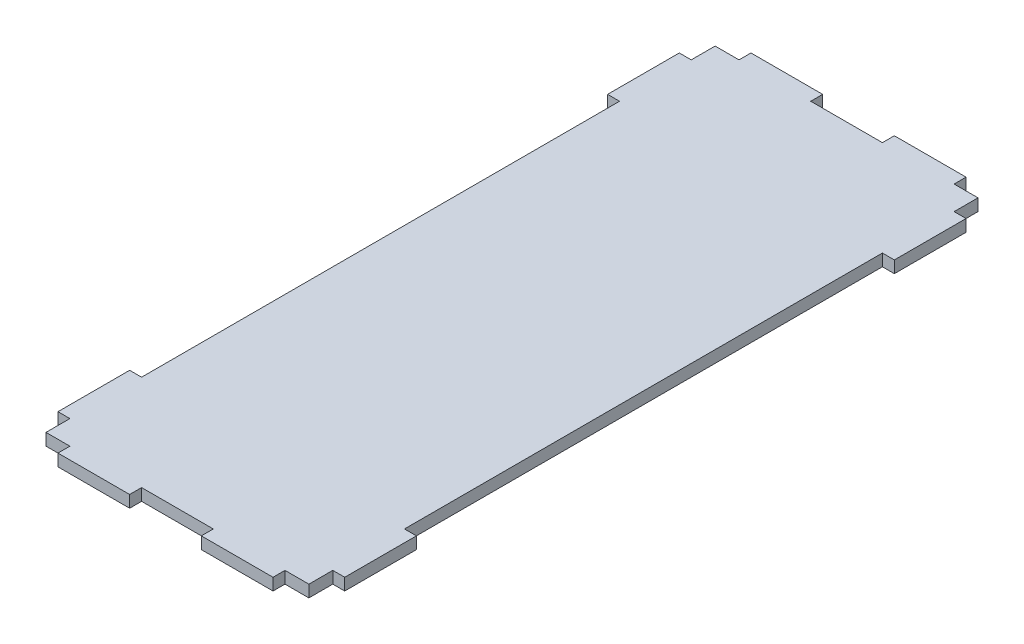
ISO-10303-21;
HEADER;
FILE_DESCRIPTION(('STEP AP214'),'2;1');
FILE_NAME('part.step','',(''),(''),'','','');
FILE_SCHEMA(('AUTOMOTIVE_DESIGN { 1 0 10303 214 1 1 1 1 }'));
ENDSEC;
DATA;
#1=APPLICATION_CONTEXT('core data for automotive mechanical design processes');
#2=APPLICATION_PROTOCOL_DEFINITION('international standard','automotive_design',2000,#1);
#3=PRODUCT_CONTEXT('',#1,'mechanical');
#4=PRODUCT('Part','Part','',(#3));
#5=PRODUCT_RELATED_PRODUCT_CATEGORY('part','',(#4));
#6=PRODUCT_DEFINITION_FORMATION('','',#4);
#7=PRODUCT_DEFINITION_CONTEXT('part definition',#1,'design');
#8=PRODUCT_DEFINITION('design','',#6,#7);
#9=PRODUCT_DEFINITION_SHAPE('','',#8);
#10=(LENGTH_UNIT() NAMED_UNIT(*) SI_UNIT(.MILLI.,.METRE.));
#11=(NAMED_UNIT(*) PLANE_ANGLE_UNIT() SI_UNIT($,.RADIAN.));
#12=(NAMED_UNIT(*) SI_UNIT($,.STERADIAN.) SOLID_ANGLE_UNIT());
#13=UNCERTAINTY_MEASURE_WITH_UNIT(LENGTH_MEASURE(1.E-05),#10,'distance_accuracy_value','');
#14=(GEOMETRIC_REPRESENTATION_CONTEXT(3) GLOBAL_UNCERTAINTY_ASSIGNED_CONTEXT((#13)) GLOBAL_UNIT_ASSIGNED_CONTEXT((#10,
#11,#12)) REPRESENTATION_CONTEXT('',''));
#15=CARTESIAN_POINT('',(0.,0.,0.));
#16=DIRECTION('',(0.,0.,1.));
#17=DIRECTION('',(1.,0.,0.));
#18=AXIS2_PLACEMENT_3D('',#15,#16,#17);
#19=CARTESIAN_POINT('',(69.85,3.175,0.));
#20=DIRECTION('',(-1.,0.,0.));
#21=DIRECTION('',(0.,0.,1.));
#22=AXIS2_PLACEMENT_3D('',#19,#20,#21);
#23=PLANE('',#22);
#24=DIRECTION('',(0.,-1.,0.));
#25=VECTOR('',#24,1.);
#26=CARTESIAN_POINT('',(69.8499999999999,3.175,-171.45));
#27=LINE('',#26,#25);
#28=CARTESIAN_POINT('',(69.85,3.175,-171.45));
#29=VERTEX_POINT('',#28);
#30=CARTESIAN_POINT('',(69.8499999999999,0.,-171.45));
#31=VERTEX_POINT('',#30);
#32=EDGE_CURVE('E303',#29,#31,#27,.T.);
#33=ORIENTED_EDGE('',*,*,#32,.T.);
#34=DIRECTION('',(0.,0.,-1.));
#35=VECTOR('',#34,1.);
#36=CARTESIAN_POINT('',(69.85,0.,0.));
#37=LINE('',#36,#35);
#38=CARTESIAN_POINT('',(69.85,0.,-177.8));
#39=VERTEX_POINT('',#38);
#40=EDGE_CURVE('E599',#31,#39,#37,.T.);
#41=ORIENTED_EDGE('',*,*,#40,.T.);
#42=DIRECTION('',(0.,-1.,0.));
#43=VECTOR('',#42,1.);
#44=CARTESIAN_POINT('',(69.85,3.175,-177.8));
#45=LINE('',#44,#43);
#46=CARTESIAN_POINT('',(69.85,3.175,-177.8));
#47=VERTEX_POINT('',#46);
#48=EDGE_CURVE('E653',#47,#39,#45,.T.);
#49=ORIENTED_EDGE('',*,*,#48,.F.);
#50=DIRECTION('',(0.,0.,-1.));
#51=VECTOR('',#50,1.);
#52=CARTESIAN_POINT('',(69.85,3.175,0.));
#53=LINE('',#52,#51);
#54=EDGE_CURVE('E37',#29,#47,#53,.T.);
#55=ORIENTED_EDGE('',*,*,#54,.F.);
#56=EDGE_LOOP('',(#33,#41,#49,#55));
#57=FACE_BOUND('',#56,.T.);
#58=ADVANCED_FACE('F33',(#57),#23,.F.);
#59=DIRECTION('',(0.,-1.,0.));
#60=VECTOR('',#59,1.);
#61=CARTESIAN_POINT('',(69.8499999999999,3.175,-152.4));
#62=LINE('',#61,#60);
#63=CARTESIAN_POINT('',(69.85,3.175,-152.4));
#64=VERTEX_POINT('',#63);
#65=CARTESIAN_POINT('',(69.85,0.,-152.4));
#66=VERTEX_POINT('',#65);
#67=EDGE_CURVE('E58',#64,#66,#62,.T.);
#68=ORIENTED_EDGE('',*,*,#67,.F.);
#69=CARTESIAN_POINT('',(69.8499999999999,3.175,-25.4));
#70=VERTEX_POINT('',#69);
#71=EDGE_CURVE('E276',#70,#64,#53,.T.);
#72=ORIENTED_EDGE('',*,*,#71,.F.);
#73=DIRECTION('',(0.,-1.,0.));
#74=VECTOR('',#73,1.);
#75=CARTESIAN_POINT('',(69.8499999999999,3.175,-25.4));
#76=LINE('',#75,#74);
#77=CARTESIAN_POINT('',(69.85,0.,-25.4));
#78=VERTEX_POINT('',#77);
#79=EDGE_CURVE('E318',#70,#78,#76,.T.);
#80=ORIENTED_EDGE('',*,*,#79,.T.);
#81=EDGE_CURVE('E598',#78,#66,#37,.T.);
#82=ORIENTED_EDGE('',*,*,#81,.T.);
#83=EDGE_LOOP('',(#68,#72,#80,#82));
#84=FACE_BOUND('',#83,.T.);
#85=ADVANCED_FACE('F715',(#84),#23,.F.);
#86=DIRECTION('',(0.,-1.,0.));
#87=VECTOR('',#86,1.);
#88=CARTESIAN_POINT('',(69.8499999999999,3.175,-6.34999999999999));
#89=LINE('',#88,#87);
#90=CARTESIAN_POINT('',(69.8499999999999,3.175,-6.34999999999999));
#91=VERTEX_POINT('',#90);
#92=CARTESIAN_POINT('',(69.8499999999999,0.,-6.34999999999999));
#93=VERTEX_POINT('',#92);
#94=EDGE_CURVE('E332',#91,#93,#89,.T.);
#95=ORIENTED_EDGE('',*,*,#94,.F.);
#96=CARTESIAN_POINT('',(69.85,3.175,0.));
#97=VERTEX_POINT('',#96);
#98=EDGE_CURVE('E600',#97,#91,#53,.T.);
#99=ORIENTED_EDGE('',*,*,#98,.F.);
#100=DIRECTION('',(0.,-1.,0.));
#101=VECTOR('',#100,1.);
#102=CARTESIAN_POINT('',(69.85,3.175,0.));
#103=LINE('',#102,#101);
#104=CARTESIAN_POINT('',(69.85,0.,0.));
#105=VERTEX_POINT('',#104);
#106=EDGE_CURVE('E43',#97,#105,#103,.T.);
#107=ORIENTED_EDGE('',*,*,#106,.T.);
#108=EDGE_CURVE('E595',#105,#93,#37,.T.);
#109=ORIENTED_EDGE('',*,*,#108,.T.);
#110=EDGE_LOOP('',(#95,#99,#107,#109));
#111=FACE_BOUND('',#110,.T.);
#112=ADVANCED_FACE('F698',(#111),#23,.F.);
#113=CARTESIAN_POINT('',(0.,3.175,0.));
#114=DIRECTION('',(1.,0.,0.));
#115=DIRECTION('',(0.,0.,-1.));
#116=AXIS2_PLACEMENT_3D('',#113,#114,#115);
#117=PLANE('',#116);
#118=DIRECTION('',(0.,-1.,0.));
#119=VECTOR('',#118,1.);
#120=CARTESIAN_POINT('',(0.,3.175,-6.34999999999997));
#121=LINE('',#120,#119);
#122=CARTESIAN_POINT('',(0.,3.175,-6.34999999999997));
#123=VERTEX_POINT('',#122);
#124=CARTESIAN_POINT('',(0.,0.,-6.34999999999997));
#125=VERTEX_POINT('',#124);
#126=EDGE_CURVE('E363',#123,#125,#121,.T.);
#127=ORIENTED_EDGE('',*,*,#126,.T.);
#128=DIRECTION('',(0.,0.,1.));
#129=VECTOR('',#128,1.);
#130=CARTESIAN_POINT('',(0.,0.,0.));
#131=LINE('',#130,#129);
#132=CARTESIAN_POINT('',(0.,0.,0.));
#133=VERTEX_POINT('',#132);
#134=EDGE_CURVE('E539',#125,#133,#131,.T.);
#135=ORIENTED_EDGE('',*,*,#134,.T.);
#136=DIRECTION('',(0.,-1.,0.));
#137=VECTOR('',#136,1.);
#138=CARTESIAN_POINT('',(0.,3.175,0.));
#139=LINE('',#138,#137);
#140=CARTESIAN_POINT('',(0.,3.175,0.));
#141=VERTEX_POINT('',#140);
#142=EDGE_CURVE('E11',#141,#133,#139,.T.);
#143=ORIENTED_EDGE('',*,*,#142,.F.);
#144=DIRECTION('',(0.,0.,1.));
#145=VECTOR('',#144,1.);
#146=CARTESIAN_POINT('',(0.,3.175,0.));
#147=LINE('',#146,#145);
#148=EDGE_CURVE('E508',#123,#141,#147,.T.);
#149=ORIENTED_EDGE('',*,*,#148,.F.);
#150=EDGE_LOOP('',(#127,#135,#143,#149));
#151=FACE_BOUND('',#150,.T.);
#152=ADVANCED_FACE('F35',(#151),#117,.F.);
#153=DIRECTION('',(0.,-1.,0.));
#154=VECTOR('',#153,1.);
#155=CARTESIAN_POINT('',(0.,3.175,-25.4));
#156=LINE('',#155,#154);
#157=CARTESIAN_POINT('',(0.,3.175,-25.4));
#158=VERTEX_POINT('',#157);
#159=CARTESIAN_POINT('',(0.,0.,-25.4));
#160=VERTEX_POINT('',#159);
#161=EDGE_CURVE('E360',#158,#160,#156,.T.);
#162=ORIENTED_EDGE('',*,*,#161,.F.);
#163=CARTESIAN_POINT('',(0.,3.175,-152.4));
#164=VERTEX_POINT('',#163);
#165=EDGE_CURVE('E383',#164,#158,#147,.T.);
#166=ORIENTED_EDGE('',*,*,#165,.F.);
#167=DIRECTION('',(0.,-1.,0.));
#168=VECTOR('',#167,1.);
#169=CARTESIAN_POINT('',(0.,3.175,-152.4));
#170=LINE('',#169,#168);
#171=CARTESIAN_POINT('',(0.,0.,-152.4));
#172=VERTEX_POINT('',#171);
#173=EDGE_CURVE('E379',#164,#172,#170,.T.);
#174=ORIENTED_EDGE('',*,*,#173,.T.);
#175=EDGE_CURVE('E585',#172,#160,#131,.T.);
#176=ORIENTED_EDGE('',*,*,#175,.T.);
#177=EDGE_LOOP('',(#162,#166,#174,#176));
#178=FACE_BOUND('',#177,.T.);
#179=ADVANCED_FACE('F1042',(#178),#117,.F.);
#180=DIRECTION('',(0.,-1.,0.));
#181=VECTOR('',#180,1.);
#182=CARTESIAN_POINT('',(0.,3.175,-171.45));
#183=LINE('',#182,#181);
#184=CARTESIAN_POINT('',(0.,3.175,-171.45));
#185=VERTEX_POINT('',#184);
#186=CARTESIAN_POINT('',(0.,0.,-171.45));
#187=VERTEX_POINT('',#186);
#188=EDGE_CURVE('E395',#185,#187,#183,.T.);
#189=ORIENTED_EDGE('',*,*,#188,.F.);
#190=CARTESIAN_POINT('',(0.,3.175,-177.8));
#191=VERTEX_POINT('',#190);
#192=EDGE_CURVE('E568',#191,#185,#147,.T.);
#193=ORIENTED_EDGE('',*,*,#192,.F.);
#194=DIRECTION('',(0.,-1.,0.));
#195=VECTOR('',#194,1.);
#196=CARTESIAN_POINT('',(0.,3.175,-177.8));
#197=LINE('',#196,#195);
#198=CARTESIAN_POINT('',(0.,0.,-177.8));
#199=VERTEX_POINT('',#198);
#200=EDGE_CURVE('E500',#191,#199,#197,.T.);
#201=ORIENTED_EDGE('',*,*,#200,.T.);
#202=EDGE_CURVE('E580',#199,#187,#131,.T.);
#203=ORIENTED_EDGE('',*,*,#202,.T.);
#204=EDGE_LOOP('',(#189,#193,#201,#203));
#205=FACE_BOUND('',#204,.T.);
#206=ADVANCED_FACE('F656',(#205),#117,.F.);
#207=CARTESIAN_POINT('',(0.,3.175,0.));
#208=DIRECTION('',(0.,0.,-1.));
#209=DIRECTION('',(-1.,0.,0.));
#210=AXIS2_PLACEMENT_3D('',#207,#208,#209);
#211=PLANE('',#210);
#212=DIRECTION('',(0.,-1.,0.));
#213=VECTOR('',#212,1.);
#214=CARTESIAN_POINT('',(6.35,3.175,0.));
#215=LINE('',#214,#213);
#216=CARTESIAN_POINT('',(6.35,3.175,0.));
#217=VERTEX_POINT('',#216);
#218=CARTESIAN_POINT('',(6.35,0.,0.));
#219=VERTEX_POINT('',#218);
#220=EDGE_CURVE('E426',#217,#219,#215,.T.);
#221=ORIENTED_EDGE('',*,*,#220,.F.);
#222=DIRECTION('',(1.,0.,0.));
#223=VECTOR('',#222,1.);
#224=CARTESIAN_POINT('',(0.,3.175,0.));
#225=LINE('',#224,#223);
#226=EDGE_CURVE('E570',#141,#217,#225,.T.);
#227=ORIENTED_EDGE('',*,*,#226,.F.);
#228=ORIENTED_EDGE('',*,*,#142,.T.);
#229=DIRECTION('',(1.,0.,0.));
#230=VECTOR('',#229,1.);
#231=CARTESIAN_POINT('',(0.,0.,0.));
#232=LINE('',#231,#230);
#233=EDGE_CURVE('E693',#133,#219,#232,.T.);
#234=ORIENTED_EDGE('',*,*,#233,.T.);
#235=EDGE_LOOP('',(#221,#227,#228,#234));
#236=FACE_BOUND('',#235,.T.);
#237=ADVANCED_FACE('F692',(#236),#211,.F.);
#238=DIRECTION('',(0.,-1.,0.));
#239=VECTOR('',#238,1.);
#240=CARTESIAN_POINT('',(25.4,3.175,0.));
#241=LINE('',#240,#239);
#242=CARTESIAN_POINT('',(25.4,3.175,0.));
#243=VERTEX_POINT('',#242);
#244=CARTESIAN_POINT('',(25.4,0.,0.));
#245=VERTEX_POINT('',#244);
#246=EDGE_CURVE('E412',#243,#245,#241,.T.);
#247=ORIENTED_EDGE('',*,*,#246,.T.);
#248=CARTESIAN_POINT('',(44.45,0.,0.));
#249=VERTEX_POINT('',#248);
#250=EDGE_CURVE('E579',#245,#249,#232,.T.);
#251=ORIENTED_EDGE('',*,*,#250,.T.);
#252=DIRECTION('',(0.,-1.,0.));
#253=VECTOR('',#252,1.);
#254=CARTESIAN_POINT('',(44.45,3.175,0.));
#255=LINE('',#254,#253);
#256=CARTESIAN_POINT('',(44.45,3.175,0.));
#257=VERTEX_POINT('',#256);
#258=EDGE_CURVE('E521',#257,#249,#255,.T.);
#259=ORIENTED_EDGE('',*,*,#258,.F.);
#260=EDGE_CURVE('E567',#243,#257,#225,.T.);
#261=ORIENTED_EDGE('',*,*,#260,.F.);
#262=EDGE_LOOP('',(#247,#251,#259,#261));
#263=FACE_BOUND('',#262,.T.);
#264=ADVANCED_FACE('F624',(#263),#211,.F.);
#265=CARTESIAN_POINT('',(69.85,3.175,-177.8));
#266=DIRECTION('',(0.,0.,1.));
#267=DIRECTION('',(1.,0.,0.));
#268=AXIS2_PLACEMENT_3D('',#265,#266,#267);
#269=PLANE('',#268);
#270=DIRECTION('',(0.,-1.,0.));
#271=VECTOR('',#270,1.);
#272=CARTESIAN_POINT('',(63.4999999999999,3.175,-177.8));
#273=LINE('',#272,#271);
#274=CARTESIAN_POINT('',(63.4999999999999,3.175,-177.8));
#275=VERTEX_POINT('',#274);
#276=CARTESIAN_POINT('',(63.4999999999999,0.,-177.8));
#277=VERTEX_POINT('',#276);
#278=EDGE_CURVE('E452',#275,#277,#273,.T.);
#279=ORIENTED_EDGE('',*,*,#278,.F.);
#280=DIRECTION('',(-1.,0.,0.));
#281=VECTOR('',#280,1.);
#282=CARTESIAN_POINT('',(69.85,3.175,-177.8));
#283=LINE('',#282,#281);
#284=EDGE_CURVE('E654',#47,#275,#283,.T.);
#285=ORIENTED_EDGE('',*,*,#284,.F.);
#286=ORIENTED_EDGE('',*,*,#48,.T.);
#287=DIRECTION('',(-1.,0.,0.));
#288=VECTOR('',#287,1.);
#289=CARTESIAN_POINT('',(69.85,0.,-177.8));
#290=LINE('',#289,#288);
#291=EDGE_CURVE('E490',#39,#277,#290,.T.);
#292=ORIENTED_EDGE('',*,*,#291,.T.);
#293=EDGE_LOOP('',(#279,#285,#286,#292));
#294=FACE_BOUND('',#293,.T.);
#295=ADVANCED_FACE('F730',(#294),#269,.F.);
#296=DIRECTION('',(0.,-1.,0.));
#297=VECTOR('',#296,1.);
#298=CARTESIAN_POINT('',(44.45,3.175,-177.8));
#299=LINE('',#298,#297);
#300=CARTESIAN_POINT('',(44.45,3.175,-177.8));
#301=VERTEX_POINT('',#300);
#302=CARTESIAN_POINT('',(44.45,0.,-177.8));
#303=VERTEX_POINT('',#302);
#304=EDGE_CURVE('E438',#301,#303,#299,.T.);
#305=ORIENTED_EDGE('',*,*,#304,.T.);
#306=CARTESIAN_POINT('',(25.4,0.,-177.8));
#307=VERTEX_POINT('',#306);
#308=EDGE_CURVE('E487',#303,#307,#290,.T.);
#309=ORIENTED_EDGE('',*,*,#308,.T.);
#310=DIRECTION('',(0.,-1.,0.));
#311=VECTOR('',#310,1.);
#312=CARTESIAN_POINT('',(25.4,3.175,-177.8));
#313=LINE('',#312,#311);
#314=CARTESIAN_POINT('',(25.4,3.175,-177.8));
#315=VERTEX_POINT('',#314);
#316=EDGE_CURVE('E469',#315,#307,#313,.T.);
#317=ORIENTED_EDGE('',*,*,#316,.F.);
#318=EDGE_CURVE('E492',#301,#315,#283,.T.);
#319=ORIENTED_EDGE('',*,*,#318,.F.);
#320=EDGE_LOOP('',(#305,#309,#317,#319));
#321=FACE_BOUND('',#320,.T.);
#322=ADVANCED_FACE('F725',(#321),#269,.F.);
#323=CARTESIAN_POINT('',(63.4999999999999,3.175,0.));
#324=VERTEX_POINT('',#323);
#325=EDGE_CURVE('E562',#324,#97,#225,.T.);
#326=ORIENTED_EDGE('',*,*,#325,.F.);
#327=DIRECTION('',(0.,-1.,0.));
#328=VECTOR('',#327,1.);
#329=CARTESIAN_POINT('',(63.4999999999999,3.175,0.));
#330=LINE('',#329,#328);
#331=CARTESIAN_POINT('',(63.4999999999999,0.,0.));
#332=VERTEX_POINT('',#331);
#333=EDGE_CURVE('E525',#324,#332,#330,.T.);
#334=ORIENTED_EDGE('',*,*,#333,.T.);
#335=EDGE_CURVE('E584',#332,#105,#232,.T.);
#336=ORIENTED_EDGE('',*,*,#335,.T.);
#337=ORIENTED_EDGE('',*,*,#106,.F.);
#338=EDGE_LOOP('',(#326,#334,#336,#337));
#339=FACE_BOUND('',#338,.T.);
#340=ADVANCED_FACE('F563',(#339),#211,.F.);
#341=CARTESIAN_POINT('',(6.34999999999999,3.175,-177.8));
#342=VERTEX_POINT('',#341);
#343=EDGE_CURVE('E601',#342,#191,#283,.T.);
#344=ORIENTED_EDGE('',*,*,#343,.F.);
#345=DIRECTION('',(0.,-1.,0.));
#346=VECTOR('',#345,1.);
#347=CARTESIAN_POINT('',(6.34999999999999,3.175,-177.8));
#348=LINE('',#347,#346);
#349=CARTESIAN_POINT('',(6.34999999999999,0.,-177.8));
#350=VERTEX_POINT('',#349);
#351=EDGE_CURVE('E478',#342,#350,#348,.T.);
#352=ORIENTED_EDGE('',*,*,#351,.T.);
#353=EDGE_CURVE('E491',#350,#199,#290,.T.);
#354=ORIENTED_EDGE('',*,*,#353,.T.);
#355=ORIENTED_EDGE('',*,*,#200,.F.);
#356=EDGE_LOOP('',(#344,#352,#354,#355));
#357=FACE_BOUND('',#356,.T.);
#358=ADVANCED_FACE('F649',(#357),#269,.F.);
#359=CARTESIAN_POINT('',(0.,3.175,0.));
#360=DIRECTION('',(0.,1.,0.));
#361=DIRECTION('',(0.,0.,1.));
#362=AXIS2_PLACEMENT_3D('',#359,#360,#361);
#363=PLANE('',#362);
#364=ORIENTED_EDGE('',*,*,#192,.T.);
#365=DIRECTION('',(-1.,0.,0.));
#366=VECTOR('',#365,1.);
#367=CARTESIAN_POINT('',(0.,3.175,-171.45));
#368=LINE('',#367,#366);
#369=CARTESIAN_POINT('',(-3.175,3.175,-171.45));
#370=VERTEX_POINT('',#369);
#371=EDGE_CURVE('E370',#185,#370,#368,.T.);
#372=ORIENTED_EDGE('',*,*,#371,.T.);
#373=DIRECTION('',(0.,0.,1.));
#374=VECTOR('',#373,1.);
#375=CARTESIAN_POINT('',(-3.175,3.175,-171.45));
#376=LINE('',#375,#374);
#377=CARTESIAN_POINT('',(-3.175,3.175,-152.4));
#378=VERTEX_POINT('',#377);
#379=EDGE_CURVE('E367',#370,#378,#376,.T.);
#380=ORIENTED_EDGE('',*,*,#379,.T.);
#381=DIRECTION('',(1.,0.,0.));
#382=VECTOR('',#381,1.);
#383=CARTESIAN_POINT('',(0.,3.175,-152.4));
#384=LINE('',#383,#382);
#385=EDGE_CURVE('E369',#378,#164,#384,.T.);
#386=ORIENTED_EDGE('',*,*,#385,.T.);
#387=ORIENTED_EDGE('',*,*,#165,.T.);
#388=DIRECTION('',(-1.,0.,0.));
#389=VECTOR('',#388,1.);
#390=CARTESIAN_POINT('',(0.,3.175,-25.4));
#391=LINE('',#390,#389);
#392=CARTESIAN_POINT('',(-3.175,3.175,-25.4));
#393=VERTEX_POINT('',#392);
#394=EDGE_CURVE('E344',#158,#393,#391,.T.);
#395=ORIENTED_EDGE('',*,*,#394,.T.);
#396=DIRECTION('',(0.,0.,1.));
#397=VECTOR('',#396,1.);
#398=CARTESIAN_POINT('',(-3.175,3.175,-6.34999999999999));
#399=LINE('',#398,#397);
#400=CARTESIAN_POINT('',(-3.175,3.175,-6.34999999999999));
#401=VERTEX_POINT('',#400);
#402=EDGE_CURVE('E347',#393,#401,#399,.T.);
#403=ORIENTED_EDGE('',*,*,#402,.T.);
#404=DIRECTION('',(1.,0.,0.));
#405=VECTOR('',#404,1.);
#406=CARTESIAN_POINT('',(0.,3.175,-6.34999999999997));
#407=LINE('',#406,#405);
#408=EDGE_CURVE('E341',#401,#123,#407,.T.);
#409=ORIENTED_EDGE('',*,*,#408,.T.);
#410=ORIENTED_EDGE('',*,*,#148,.T.);
#411=ORIENTED_EDGE('',*,*,#226,.T.);
#412=DIRECTION('',(0.,0.,1.));
#413=VECTOR('',#412,1.);
#414=CARTESIAN_POINT('',(6.35,3.175,0.));
#415=LINE('',#414,#413);
#416=CARTESIAN_POINT('',(6.35,3.175,3.175));
#417=VERTEX_POINT('',#416);
#418=EDGE_CURVE('E404',#217,#417,#415,.T.);
#419=ORIENTED_EDGE('',*,*,#418,.T.);
#420=DIRECTION('',(1.,0.,0.));
#421=VECTOR('',#420,1.);
#422=CARTESIAN_POINT('',(6.35,3.175,3.175));
#423=LINE('',#422,#421);
#424=CARTESIAN_POINT('',(25.4,3.175,3.17499999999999));
#425=VERTEX_POINT('',#424);
#426=EDGE_CURVE('E406',#417,#425,#423,.T.);
#427=ORIENTED_EDGE('',*,*,#426,.T.);
#428=DIRECTION('',(0.,0.,-1.));
#429=VECTOR('',#428,1.);
#430=CARTESIAN_POINT('',(25.4,3.175,0.));
#431=LINE('',#430,#429);
#432=EDGE_CURVE('E409',#425,#243,#431,.T.);
#433=ORIENTED_EDGE('',*,*,#432,.T.);
#434=ORIENTED_EDGE('',*,*,#260,.T.);
#435=DIRECTION('',(0.,0.,1.));
#436=VECTOR('',#435,1.);
#437=CARTESIAN_POINT('',(44.45,3.175,0.));
#438=LINE('',#437,#436);
#439=CARTESIAN_POINT('',(44.4499999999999,3.175,3.17499999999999));
#440=VERTEX_POINT('',#439);
#441=EDGE_CURVE('E517',#257,#440,#438,.T.);
#442=ORIENTED_EDGE('',*,*,#441,.T.);
#443=DIRECTION('',(1.,0.,0.));
#444=VECTOR('',#443,1.);
#445=CARTESIAN_POINT('',(63.4999999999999,3.175,3.175));
#446=LINE('',#445,#444);
#447=CARTESIAN_POINT('',(63.4999999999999,3.175,3.175));
#448=VERTEX_POINT('',#447);
#449=EDGE_CURVE('E519',#440,#448,#446,.T.);
#450=ORIENTED_EDGE('',*,*,#449,.T.);
#451=DIRECTION('',(0.,0.,-1.));
#452=VECTOR('',#451,1.);
#453=CARTESIAN_POINT('',(63.4999999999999,3.175,0.));
#454=LINE('',#453,#452);
#455=EDGE_CURVE('E520',#448,#324,#454,.T.);
#456=ORIENTED_EDGE('',*,*,#455,.T.);
#457=ORIENTED_EDGE('',*,*,#325,.T.);
#458=ORIENTED_EDGE('',*,*,#98,.T.);
#459=DIRECTION('',(1.,0.,0.));
#460=VECTOR('',#459,1.);
#461=CARTESIAN_POINT('',(69.8499999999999,3.175,-6.34999999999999));
#462=LINE('',#461,#460);
#463=CARTESIAN_POINT('',(73.0249999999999,3.175,-6.34999999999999));
#464=VERTEX_POINT('',#463);
#465=EDGE_CURVE('E309',#91,#464,#462,.T.);
#466=ORIENTED_EDGE('',*,*,#465,.T.);
#467=DIRECTION('',(0.,0.,-1.));
#468=VECTOR('',#467,1.);
#469=CARTESIAN_POINT('',(73.0249999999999,3.175,-6.34999999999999));
#470=LINE('',#469,#468);
#471=CARTESIAN_POINT('',(73.0249999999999,3.175,-25.4));
#472=VERTEX_POINT('',#471);
#473=EDGE_CURVE('E306',#464,#472,#470,.T.);
#474=ORIENTED_EDGE('',*,*,#473,.T.);
#475=DIRECTION('',(-1.,0.,0.));
#476=VECTOR('',#475,1.);
#477=CARTESIAN_POINT('',(69.8499999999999,3.175,-25.4));
#478=LINE('',#477,#476);
#479=EDGE_CURVE('E308',#472,#70,#478,.T.);
#480=ORIENTED_EDGE('',*,*,#479,.T.);
#481=ORIENTED_EDGE('',*,*,#71,.T.);
#482=DIRECTION('',(1.,0.,0.));
#483=VECTOR('',#482,1.);
#484=CARTESIAN_POINT('',(69.8499999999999,3.175,-152.4));
#485=LINE('',#484,#483);
#486=CARTESIAN_POINT('',(73.0249999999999,3.175,-152.4));
#487=VERTEX_POINT('',#486);
#488=EDGE_CURVE('E269',#64,#487,#485,.T.);
#489=ORIENTED_EDGE('',*,*,#488,.T.);
#490=DIRECTION('',(0.,0.,-1.));
#491=VECTOR('',#490,1.);
#492=CARTESIAN_POINT('',(73.0249999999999,3.175,-171.45));
#493=LINE('',#492,#491);
#494=CARTESIAN_POINT('',(73.0249999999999,3.175,-171.45));
#495=VERTEX_POINT('',#494);
#496=EDGE_CURVE('E274',#487,#495,#493,.T.);
#497=ORIENTED_EDGE('',*,*,#496,.T.);
#498=DIRECTION('',(-1.,0.,0.));
#499=VECTOR('',#498,1.);
#500=CARTESIAN_POINT('',(69.8499999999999,3.175,-171.45));
#501=LINE('',#500,#499);
#502=EDGE_CURVE('E278',#495,#29,#501,.T.);
#503=ORIENTED_EDGE('',*,*,#502,.T.);
#504=ORIENTED_EDGE('',*,*,#54,.T.);
#505=ORIENTED_EDGE('',*,*,#284,.T.);
#506=DIRECTION('',(0.,0.,-1.));
#507=VECTOR('',#506,1.);
#508=CARTESIAN_POINT('',(63.4999999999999,3.175,-177.8));
#509=LINE('',#508,#507);
#510=CARTESIAN_POINT('',(63.4999999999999,3.175,-180.975));
#511=VERTEX_POINT('',#510);
#512=EDGE_CURVE('E430',#275,#511,#509,.T.);
#513=ORIENTED_EDGE('',*,*,#512,.T.);
#514=DIRECTION('',(-1.,0.,0.));
#515=VECTOR('',#514,1.);
#516=CARTESIAN_POINT('',(63.4999999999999,3.175,-180.975));
#517=LINE('',#516,#515);
#518=CARTESIAN_POINT('',(44.4499999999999,3.175,-180.975));
#519=VERTEX_POINT('',#518);
#520=EDGE_CURVE('E432',#511,#519,#517,.T.);
#521=ORIENTED_EDGE('',*,*,#520,.T.);
#522=DIRECTION('',(0.,0.,1.));
#523=VECTOR('',#522,1.);
#524=CARTESIAN_POINT('',(44.45,3.175,-177.8));
#525=LINE('',#524,#523);
#526=EDGE_CURVE('E435',#519,#301,#525,.T.);
#527=ORIENTED_EDGE('',*,*,#526,.T.);
#528=ORIENTED_EDGE('',*,*,#318,.T.);
#529=DIRECTION('',(0.,0.,-1.));
#530=VECTOR('',#529,1.);
#531=CARTESIAN_POINT('',(25.4,3.175,-177.8));
#532=LINE('',#531,#530);
#533=CARTESIAN_POINT('',(25.4,3.175,-180.975));
#534=VERTEX_POINT('',#533);
#535=EDGE_CURVE('E459',#315,#534,#532,.T.);
#536=ORIENTED_EDGE('',*,*,#535,.T.);
#537=DIRECTION('',(-1.,0.,0.));
#538=VECTOR('',#537,1.);
#539=CARTESIAN_POINT('',(6.34999999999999,3.175,-180.975));
#540=LINE('',#539,#538);
#541=CARTESIAN_POINT('',(6.34999999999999,3.175,-180.975));
#542=VERTEX_POINT('',#541);
#543=EDGE_CURVE('E456',#534,#542,#540,.T.);
#544=ORIENTED_EDGE('',*,*,#543,.T.);
#545=DIRECTION('',(0.,0.,1.));
#546=VECTOR('',#545,1.);
#547=CARTESIAN_POINT('',(6.34999999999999,3.175,-177.8));
#548=LINE('',#547,#546);
#549=EDGE_CURVE('E462',#542,#342,#548,.T.);
#550=ORIENTED_EDGE('',*,*,#549,.T.);
#551=ORIENTED_EDGE('',*,*,#343,.T.);
#552=EDGE_LOOP('',(#364,#372,#380,#386,#387,#395,#403,#409,#410,#411,#419,#427,#433,#434,#442,
#450,#456,#457,#458,#466,#474,#480,#481,#489,#497,#503,#504,#505,#513,#521,#527,#528,#536,#544,
#550,#551));
#553=FACE_BOUND('',#552,.T.);
#554=ADVANCED_FACE('F272',(#553),#363,.T.);
#555=CARTESIAN_POINT('',(0.,0.,0.));
#556=DIRECTION('',(0.,1.,0.));
#557=DIRECTION('',(0.,0.,1.));
#558=AXIS2_PLACEMENT_3D('',#555,#556,#557);
#559=PLANE('',#558);
#560=ORIENTED_EDGE('',*,*,#202,.F.);
#561=ORIENTED_EDGE('',*,*,#353,.F.);
#562=DIRECTION('',(0.,0.,1.));
#563=VECTOR('',#562,1.);
#564=CARTESIAN_POINT('',(6.34999999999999,0.,-177.8));
#565=LINE('',#564,#563);
#566=CARTESIAN_POINT('',(6.34999999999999,0.,-180.975));
#567=VERTEX_POINT('',#566);
#568=EDGE_CURVE('E455',#567,#350,#565,.T.);
#569=ORIENTED_EDGE('',*,*,#568,.F.);
#570=DIRECTION('',(-1.,0.,0.));
#571=VECTOR('',#570,1.);
#572=CARTESIAN_POINT('',(6.34999999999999,0.,-180.975));
#573=LINE('',#572,#571);
#574=CARTESIAN_POINT('',(25.4,0.,-180.975));
#575=VERTEX_POINT('',#574);
#576=EDGE_CURVE('E460',#575,#567,#573,.T.);
#577=ORIENTED_EDGE('',*,*,#576,.F.);
#578=DIRECTION('',(0.,0.,-1.));
#579=VECTOR('',#578,1.);
#580=CARTESIAN_POINT('',(25.4,0.,-177.8));
#581=LINE('',#580,#579);
#582=EDGE_CURVE('E463',#307,#575,#581,.T.);
#583=ORIENTED_EDGE('',*,*,#582,.F.);
#584=ORIENTED_EDGE('',*,*,#308,.F.);
#585=DIRECTION('',(0.,0.,1.));
#586=VECTOR('',#585,1.);
#587=CARTESIAN_POINT('',(44.45,0.,-177.8));
#588=LINE('',#587,#586);
#589=CARTESIAN_POINT('',(44.4499999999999,0.,-180.975));
#590=VERTEX_POINT('',#589);
#591=EDGE_CURVE('E433',#590,#303,#588,.T.);
#592=ORIENTED_EDGE('',*,*,#591,.F.);
#593=DIRECTION('',(-1.,0.,0.));
#594=VECTOR('',#593,1.);
#595=CARTESIAN_POINT('',(63.4999999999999,0.,-180.975));
#596=LINE('',#595,#594);
#597=CARTESIAN_POINT('',(63.4999999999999,0.,-180.975));
#598=VERTEX_POINT('',#597);
#599=EDGE_CURVE('E440',#598,#590,#596,.T.);
#600=ORIENTED_EDGE('',*,*,#599,.F.);
#601=DIRECTION('',(0.,0.,-1.));
#602=VECTOR('',#601,1.);
#603=CARTESIAN_POINT('',(63.4999999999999,0.,-177.8));
#604=LINE('',#603,#602);
#605=EDGE_CURVE('E429',#277,#598,#604,.T.);
#606=ORIENTED_EDGE('',*,*,#605,.F.);
#607=ORIENTED_EDGE('',*,*,#291,.F.);
#608=ORIENTED_EDGE('',*,*,#40,.F.);
#609=DIRECTION('',(-1.,0.,0.));
#610=VECTOR('',#609,1.);
#611=CARTESIAN_POINT('',(69.8499999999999,0.,-171.45));
#612=LINE('',#611,#610);
#613=CARTESIAN_POINT('',(73.0249999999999,0.,-171.45));
#614=VERTEX_POINT('',#613);
#615=EDGE_CURVE('E296',#614,#31,#612,.T.);
#616=ORIENTED_EDGE('',*,*,#615,.F.);
#617=DIRECTION('',(0.,0.,-1.));
#618=VECTOR('',#617,1.);
#619=CARTESIAN_POINT('',(73.0249999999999,0.,-171.45));
#620=LINE('',#619,#618);
#621=CARTESIAN_POINT('',(73.0249999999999,0.,-152.4));
#622=VERTEX_POINT('',#621);
#623=EDGE_CURVE('E300',#622,#614,#620,.T.);
#624=ORIENTED_EDGE('',*,*,#623,.F.);
#625=DIRECTION('',(1.,0.,0.));
#626=VECTOR('',#625,1.);
#627=CARTESIAN_POINT('',(69.8499999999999,0.,-152.4));
#628=LINE('',#627,#626);
#629=EDGE_CURVE('E284',#66,#622,#628,.T.);
#630=ORIENTED_EDGE('',*,*,#629,.F.);
#631=ORIENTED_EDGE('',*,*,#81,.F.);
#632=DIRECTION('',(-1.,0.,0.));
#633=VECTOR('',#632,1.);
#634=CARTESIAN_POINT('',(69.8499999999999,0.,-25.4));
#635=LINE('',#634,#633);
#636=CARTESIAN_POINT('',(73.0249999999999,0.,-25.4));
#637=VERTEX_POINT('',#636);
#638=EDGE_CURVE('E312',#637,#78,#635,.T.);
#639=ORIENTED_EDGE('',*,*,#638,.F.);
#640=DIRECTION('',(0.,0.,-1.));
#641=VECTOR('',#640,1.);
#642=CARTESIAN_POINT('',(73.0249999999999,0.,-6.34999999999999));
#643=LINE('',#642,#641);
#644=CARTESIAN_POINT('',(73.0249999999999,0.,-6.34999999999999));
#645=VERTEX_POINT('',#644);
#646=EDGE_CURVE('E310',#645,#637,#643,.T.);
#647=ORIENTED_EDGE('',*,*,#646,.F.);
#648=DIRECTION('',(1.,0.,0.));
#649=VECTOR('',#648,1.);
#650=CARTESIAN_POINT('',(69.8499999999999,0.,-6.34999999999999));
#651=LINE('',#650,#649);
#652=EDGE_CURVE('E305',#93,#645,#651,.T.);
#653=ORIENTED_EDGE('',*,*,#652,.F.);
#654=ORIENTED_EDGE('',*,*,#108,.F.);
#655=ORIENTED_EDGE('',*,*,#335,.F.);
#656=DIRECTION('',(0.,0.,-1.));
#657=VECTOR('',#656,1.);
#658=CARTESIAN_POINT('',(63.4999999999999,0.,0.));
#659=LINE('',#658,#657);
#660=CARTESIAN_POINT('',(63.4999999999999,0.,3.175));
#661=VERTEX_POINT('',#660);
#662=EDGE_CURVE('E514',#661,#332,#659,.T.);
#663=ORIENTED_EDGE('',*,*,#662,.F.);
#664=DIRECTION('',(1.,0.,0.));
#665=VECTOR('',#664,1.);
#666=CARTESIAN_POINT('',(63.4999999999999,0.,3.175));
#667=LINE('',#666,#665);
#668=CARTESIAN_POINT('',(44.4499999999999,0.,3.17499999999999));
#669=VERTEX_POINT('',#668);
#670=EDGE_CURVE('E513',#669,#661,#667,.T.);
#671=ORIENTED_EDGE('',*,*,#670,.F.);
#672=DIRECTION('',(0.,0.,1.));
#673=VECTOR('',#672,1.);
#674=CARTESIAN_POINT('',(44.45,0.,0.));
#675=LINE('',#674,#673);
#676=EDGE_CURVE('E511',#249,#669,#675,.T.);
#677=ORIENTED_EDGE('',*,*,#676,.F.);
#678=ORIENTED_EDGE('',*,*,#250,.F.);
#679=DIRECTION('',(0.,0.,-1.));
#680=VECTOR('',#679,1.);
#681=CARTESIAN_POINT('',(25.4,0.,0.));
#682=LINE('',#681,#680);
#683=CARTESIAN_POINT('',(25.4,0.,3.17499999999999));
#684=VERTEX_POINT('',#683);
#685=EDGE_CURVE('E407',#684,#245,#682,.T.);
#686=ORIENTED_EDGE('',*,*,#685,.F.);
#687=DIRECTION('',(1.,0.,0.));
#688=VECTOR('',#687,1.);
#689=CARTESIAN_POINT('',(6.35,0.,3.175));
#690=LINE('',#689,#688);
#691=CARTESIAN_POINT('',(6.35,0.,3.175));
#692=VERTEX_POINT('',#691);
#693=EDGE_CURVE('E414',#692,#684,#690,.T.);
#694=ORIENTED_EDGE('',*,*,#693,.F.);
#695=DIRECTION('',(0.,0.,1.));
#696=VECTOR('',#695,1.);
#697=CARTESIAN_POINT('',(6.35,0.,0.));
#698=LINE('',#697,#696);
#699=EDGE_CURVE('E399',#219,#692,#698,.T.);
#700=ORIENTED_EDGE('',*,*,#699,.F.);
#701=ORIENTED_EDGE('',*,*,#233,.F.);
#702=ORIENTED_EDGE('',*,*,#134,.F.);
#703=DIRECTION('',(1.,0.,0.));
#704=VECTOR('',#703,1.);
#705=CARTESIAN_POINT('',(0.,0.,-6.34999999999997));
#706=LINE('',#705,#704);
#707=CARTESIAN_POINT('',(-3.175,0.,-6.34999999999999));
#708=VERTEX_POINT('',#707);
#709=EDGE_CURVE('E336',#708,#125,#706,.T.);
#710=ORIENTED_EDGE('',*,*,#709,.F.);
#711=DIRECTION('',(0.,0.,1.));
#712=VECTOR('',#711,1.);
#713=CARTESIAN_POINT('',(-3.175,0.,-6.34999999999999));
#714=LINE('',#713,#712);
#715=CARTESIAN_POINT('',(-3.175,0.,-25.4));
#716=VERTEX_POINT('',#715);
#717=EDGE_CURVE('E345',#716,#708,#714,.T.);
#718=ORIENTED_EDGE('',*,*,#717,.F.);
#719=DIRECTION('',(-1.,0.,0.));
#720=VECTOR('',#719,1.);
#721=CARTESIAN_POINT('',(0.,0.,-25.4));
#722=LINE('',#721,#720);
#723=EDGE_CURVE('E352',#160,#716,#722,.T.);
#724=ORIENTED_EDGE('',*,*,#723,.F.);
#725=ORIENTED_EDGE('',*,*,#175,.F.);
#726=DIRECTION('',(1.,0.,0.));
#727=VECTOR('',#726,1.);
#728=CARTESIAN_POINT('',(0.,0.,-152.4));
#729=LINE('',#728,#727);
#730=CARTESIAN_POINT('',(-3.175,0.,-152.4));
#731=VERTEX_POINT('',#730);
#732=EDGE_CURVE('E373',#731,#172,#729,.T.);
#733=ORIENTED_EDGE('',*,*,#732,.F.);
#734=DIRECTION('',(0.,0.,1.));
#735=VECTOR('',#734,1.);
#736=CARTESIAN_POINT('',(-3.175,0.,-171.45));
#737=LINE('',#736,#735);
#738=CARTESIAN_POINT('',(-3.175,0.,-171.45));
#739=VERTEX_POINT('',#738);
#740=EDGE_CURVE('E371',#739,#731,#737,.T.);
#741=ORIENTED_EDGE('',*,*,#740,.F.);
#742=DIRECTION('',(-1.,0.,0.));
#743=VECTOR('',#742,1.);
#744=CARTESIAN_POINT('',(0.,0.,-171.45));
#745=LINE('',#744,#743);
#746=EDGE_CURVE('E366',#187,#739,#745,.T.);
#747=ORIENTED_EDGE('',*,*,#746,.F.);
#748=EDGE_LOOP('',(#560,#561,#569,#577,#583,#584,#592,#600,#606,#607,#608,#616,#624,#630,#631,
#639,#647,#653,#654,#655,#663,#671,#677,#678,#686,#694,#700,#701,#702,#710,#718,#724,#725,#733,
#741,#747));
#749=FACE_BOUND('',#748,.T.);
#750=ADVANCED_FACE('F631',(#749),#559,.F.);
#751=CARTESIAN_POINT('',(63.4999999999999,3.175,0.));
#752=DIRECTION('',(-1.,0.,0.));
#753=DIRECTION('',(0.,0.,1.));
#754=AXIS2_PLACEMENT_3D('',#751,#752,#753);
#755=PLANE('',#754);
#756=ORIENTED_EDGE('',*,*,#662,.T.);
#757=ORIENTED_EDGE('',*,*,#333,.F.);
#758=ORIENTED_EDGE('',*,*,#455,.F.);
#759=DIRECTION('',(0.,-1.,0.));
#760=VECTOR('',#759,1.);
#761=CARTESIAN_POINT('',(63.4999999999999,3.175,3.175));
#762=LINE('',#761,#760);
#763=EDGE_CURVE('E550',#448,#661,#762,.T.);
#764=ORIENTED_EDGE('',*,*,#763,.T.);
#765=EDGE_LOOP('',(#756,#757,#758,#764));
#766=FACE_BOUND('',#765,.T.);
#767=ADVANCED_FACE('F557',(#766),#755,.F.);
#768=CARTESIAN_POINT('',(44.45,3.175,0.));
#769=DIRECTION('',(1.,0.,0.));
#770=DIRECTION('',(0.,0.,-1.));
#771=AXIS2_PLACEMENT_3D('',#768,#769,#770);
#772=PLANE('',#771);
#773=ORIENTED_EDGE('',*,*,#676,.T.);
#774=DIRECTION('',(0.,-1.,0.));
#775=VECTOR('',#774,1.);
#776=CARTESIAN_POINT('',(44.4499999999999,3.175,3.17499999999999));
#777=LINE('',#776,#775);
#778=EDGE_CURVE('E526',#440,#669,#777,.T.);
#779=ORIENTED_EDGE('',*,*,#778,.F.);
#780=ORIENTED_EDGE('',*,*,#441,.F.);
#781=ORIENTED_EDGE('',*,*,#258,.T.);
#782=EDGE_LOOP('',(#773,#779,#780,#781));
#783=FACE_BOUND('',#782,.T.);
#784=ADVANCED_FACE('F628',(#783),#772,.F.);
#785=CARTESIAN_POINT('',(63.4999999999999,3.175,3.175));
#786=DIRECTION('',(0.,0.,-1.));
#787=DIRECTION('',(-1.,0.,0.));
#788=AXIS2_PLACEMENT_3D('',#785,#786,#787);
#789=PLANE('',#788);
#790=ORIENTED_EDGE('',*,*,#670,.T.);
#791=ORIENTED_EDGE('',*,*,#763,.F.);
#792=ORIENTED_EDGE('',*,*,#449,.F.);
#793=ORIENTED_EDGE('',*,*,#778,.T.);
#794=EDGE_LOOP('',(#790,#791,#792,#793));
#795=FACE_BOUND('',#794,.T.);
#796=ADVANCED_FACE('F556',(#795),#789,.F.);
#797=CARTESIAN_POINT('',(6.34999999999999,3.175,-177.8));
#798=DIRECTION('',(1.,0.,0.));
#799=DIRECTION('',(0.,0.,-1.));
#800=AXIS2_PLACEMENT_3D('',#797,#798,#799);
#801=PLANE('',#800);
#802=ORIENTED_EDGE('',*,*,#568,.T.);
#803=ORIENTED_EDGE('',*,*,#351,.F.);
#804=ORIENTED_EDGE('',*,*,#549,.F.);
#805=DIRECTION('',(0.,-1.,0.));
#806=VECTOR('',#805,1.);
#807=CARTESIAN_POINT('',(6.34999999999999,3.175,-180.975));
#808=LINE('',#807,#806);
#809=EDGE_CURVE('E458',#542,#567,#808,.T.);
#810=ORIENTED_EDGE('',*,*,#809,.T.);
#811=EDGE_LOOP('',(#802,#803,#804,#810));
#812=FACE_BOUND('',#811,.T.);
#813=ADVANCED_FACE('F647',(#812),#801,.F.);
#814=CARTESIAN_POINT('',(25.4,3.175,-177.8));
#815=DIRECTION('',(-1.,0.,0.));
#816=DIRECTION('',(0.,0.,1.));
#817=AXIS2_PLACEMENT_3D('',#814,#815,#816);
#818=PLANE('',#817);
#819=ORIENTED_EDGE('',*,*,#582,.T.);
#820=DIRECTION('',(0.,-1.,0.));
#821=VECTOR('',#820,1.);
#822=CARTESIAN_POINT('',(25.4,3.175,-180.975));
#823=LINE('',#822,#821);
#824=EDGE_CURVE('E466',#534,#575,#823,.T.);
#825=ORIENTED_EDGE('',*,*,#824,.F.);
#826=ORIENTED_EDGE('',*,*,#535,.F.);
#827=ORIENTED_EDGE('',*,*,#316,.T.);
#828=EDGE_LOOP('',(#819,#825,#826,#827));
#829=FACE_BOUND('',#828,.T.);
#830=ADVANCED_FACE('F762',(#829),#818,.F.);
#831=CARTESIAN_POINT('',(6.34999999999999,3.175,-180.975));
#832=DIRECTION('',(0.,0.,1.));
#833=DIRECTION('',(1.,0.,0.));
#834=AXIS2_PLACEMENT_3D('',#831,#832,#833);
#835=PLANE('',#834);
#836=ORIENTED_EDGE('',*,*,#576,.T.);
#837=ORIENTED_EDGE('',*,*,#809,.F.);
#838=ORIENTED_EDGE('',*,*,#543,.F.);
#839=ORIENTED_EDGE('',*,*,#824,.T.);
#840=EDGE_LOOP('',(#836,#837,#838,#839));
#841=FACE_BOUND('',#840,.T.);
#842=ADVANCED_FACE('F766',(#841),#835,.F.);
#843=CARTESIAN_POINT('',(63.4999999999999,3.175,-177.8));
#844=DIRECTION('',(-1.,0.,0.));
#845=DIRECTION('',(0.,0.,1.));
#846=AXIS2_PLACEMENT_3D('',#843,#844,#845);
#847=PLANE('',#846);
#848=ORIENTED_EDGE('',*,*,#605,.T.);
#849=DIRECTION('',(0.,-1.,0.));
#850=VECTOR('',#849,1.);
#851=CARTESIAN_POINT('',(63.4999999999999,3.175,-180.975));
#852=LINE('',#851,#850);
#853=EDGE_CURVE('E449',#511,#598,#852,.T.);
#854=ORIENTED_EDGE('',*,*,#853,.F.);
#855=ORIENTED_EDGE('',*,*,#512,.F.);
#856=ORIENTED_EDGE('',*,*,#278,.T.);
#857=EDGE_LOOP('',(#848,#854,#855,#856));
#858=FACE_BOUND('',#857,.T.);
#859=ADVANCED_FACE('F747',(#858),#847,.F.);
#860=CARTESIAN_POINT('',(63.4999999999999,3.175,-180.975));
#861=DIRECTION('',(0.,0.,1.));
#862=DIRECTION('',(1.,0.,0.));
#863=AXIS2_PLACEMENT_3D('',#860,#861,#862);
#864=PLANE('',#863);
#865=ORIENTED_EDGE('',*,*,#599,.T.);
#866=DIRECTION('',(0.,-1.,0.));
#867=VECTOR('',#866,1.);
#868=CARTESIAN_POINT('',(44.4499999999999,3.175,-180.975));
#869=LINE('',#868,#867);
#870=EDGE_CURVE('E446',#519,#590,#869,.T.);
#871=ORIENTED_EDGE('',*,*,#870,.F.);
#872=ORIENTED_EDGE('',*,*,#520,.F.);
#873=ORIENTED_EDGE('',*,*,#853,.T.);
#874=EDGE_LOOP('',(#865,#871,#872,#873));
#875=FACE_BOUND('',#874,.T.);
#876=ADVANCED_FACE('F752',(#875),#864,.F.);
#877=CARTESIAN_POINT('',(44.45,3.175,-177.8));
#878=DIRECTION('',(1.,0.,0.));
#879=DIRECTION('',(0.,0.,-1.));
#880=AXIS2_PLACEMENT_3D('',#877,#878,#879);
#881=PLANE('',#880);
#882=ORIENTED_EDGE('',*,*,#591,.T.);
#883=ORIENTED_EDGE('',*,*,#304,.F.);
#884=ORIENTED_EDGE('',*,*,#526,.F.);
#885=ORIENTED_EDGE('',*,*,#870,.T.);
#886=EDGE_LOOP('',(#882,#883,#884,#885));
#887=FACE_BOUND('',#886,.T.);
#888=ADVANCED_FACE('F757',(#887),#881,.F.);
#889=CARTESIAN_POINT('',(6.35,3.175,0.));
#890=DIRECTION('',(1.,0.,0.));
#891=DIRECTION('',(0.,0.,-1.));
#892=AXIS2_PLACEMENT_3D('',#889,#890,#891);
#893=PLANE('',#892);
#894=ORIENTED_EDGE('',*,*,#699,.T.);
#895=DIRECTION('',(0.,-1.,0.));
#896=VECTOR('',#895,1.);
#897=CARTESIAN_POINT('',(6.35,3.175,3.175));
#898=LINE('',#897,#896);
#899=EDGE_CURVE('E423',#417,#692,#898,.T.);
#900=ORIENTED_EDGE('',*,*,#899,.F.);
#901=ORIENTED_EDGE('',*,*,#418,.F.);
#902=ORIENTED_EDGE('',*,*,#220,.T.);
#903=EDGE_LOOP('',(#894,#900,#901,#902));
#904=FACE_BOUND('',#903,.T.);
#905=ADVANCED_FACE('F611',(#904),#893,.F.);
#906=CARTESIAN_POINT('',(6.35,3.175,3.175));
#907=DIRECTION('',(0.,0.,-1.));
#908=DIRECTION('',(-1.,0.,0.));
#909=AXIS2_PLACEMENT_3D('',#906,#907,#908);
#910=PLANE('',#909);
#911=ORIENTED_EDGE('',*,*,#693,.T.);
#912=DIRECTION('',(0.,-1.,0.));
#913=VECTOR('',#912,1.);
#914=CARTESIAN_POINT('',(25.4,3.175,3.17499999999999));
#915=LINE('',#914,#913);
#916=EDGE_CURVE('E420',#425,#684,#915,.T.);
#917=ORIENTED_EDGE('',*,*,#916,.F.);
#918=ORIENTED_EDGE('',*,*,#426,.F.);
#919=ORIENTED_EDGE('',*,*,#899,.T.);
#920=EDGE_LOOP('',(#911,#917,#918,#919));
#921=FACE_BOUND('',#920,.T.);
#922=ADVANCED_FACE('F617',(#921),#910,.F.);
#923=CARTESIAN_POINT('',(25.4,3.175,0.));
#924=DIRECTION('',(-1.,0.,0.));
#925=DIRECTION('',(0.,0.,1.));
#926=AXIS2_PLACEMENT_3D('',#923,#924,#925);
#927=PLANE('',#926);
#928=ORIENTED_EDGE('',*,*,#685,.T.);
#929=ORIENTED_EDGE('',*,*,#246,.F.);
#930=ORIENTED_EDGE('',*,*,#432,.F.);
#931=ORIENTED_EDGE('',*,*,#916,.T.);
#932=EDGE_LOOP('',(#928,#929,#930,#931));
#933=FACE_BOUND('',#932,.T.);
#934=ADVANCED_FACE('F621',(#933),#927,.F.);
#935=CARTESIAN_POINT('',(0.,3.175,-171.45));
#936=DIRECTION('',(0.,0.,1.));
#937=DIRECTION('',(1.,0.,0.));
#938=AXIS2_PLACEMENT_3D('',#935,#936,#937);
#939=PLANE('',#938);
#940=ORIENTED_EDGE('',*,*,#746,.T.);
#941=DIRECTION('',(0.,-1.,0.));
#942=VECTOR('',#941,1.);
#943=CARTESIAN_POINT('',(-3.175,3.175,-171.45));
#944=LINE('',#943,#942);
#945=EDGE_CURVE('E400',#370,#739,#944,.T.);
#946=ORIENTED_EDGE('',*,*,#945,.F.);
#947=ORIENTED_EDGE('',*,*,#371,.F.);
#948=ORIENTED_EDGE('',*,*,#188,.T.);
#949=EDGE_LOOP('',(#940,#946,#947,#948));
#950=FACE_BOUND('',#949,.T.);
#951=ADVANCED_FACE('F662',(#950),#939,.F.);
#952=CARTESIAN_POINT('',(-3.175,3.175,-171.45));
#953=DIRECTION('',(1.,0.,0.));
#954=DIRECTION('',(0.,0.,-1.));
#955=AXIS2_PLACEMENT_3D('',#952,#953,#954);
#956=PLANE('',#955);
#957=ORIENTED_EDGE('',*,*,#740,.T.);
#958=DIRECTION('',(0.,-1.,0.));
#959=VECTOR('',#958,1.);
#960=CARTESIAN_POINT('',(-3.175,3.175,-152.4));
#961=LINE('',#960,#959);
#962=EDGE_CURVE('E376',#378,#731,#961,.T.);
#963=ORIENTED_EDGE('',*,*,#962,.F.);
#964=ORIENTED_EDGE('',*,*,#379,.F.);
#965=ORIENTED_EDGE('',*,*,#945,.T.);
#966=EDGE_LOOP('',(#957,#963,#964,#965));
#967=FACE_BOUND('',#966,.T.);
#968=ADVANCED_FACE('F665',(#967),#956,.F.);
#969=CARTESIAN_POINT('',(0.,3.175,-152.4));
#970=DIRECTION('',(0.,0.,-1.));
#971=DIRECTION('',(-1.,0.,0.));
#972=AXIS2_PLACEMENT_3D('',#969,#970,#971);
#973=PLANE('',#972);
#974=ORIENTED_EDGE('',*,*,#732,.T.);
#975=ORIENTED_EDGE('',*,*,#173,.F.);
#976=ORIENTED_EDGE('',*,*,#385,.F.);
#977=ORIENTED_EDGE('',*,*,#962,.T.);
#978=EDGE_LOOP('',(#974,#975,#976,#977));
#979=FACE_BOUND('',#978,.T.);
#980=ADVANCED_FACE('F671',(#979),#973,.F.);
#981=CARTESIAN_POINT('',(0.,3.175,-6.34999999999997));
#982=DIRECTION('',(0.,0.,-1.));
#983=DIRECTION('',(-1.,0.,0.));
#984=AXIS2_PLACEMENT_3D('',#981,#982,#983);
#985=PLANE('',#984);
#986=ORIENTED_EDGE('',*,*,#709,.T.);
#987=ORIENTED_EDGE('',*,*,#126,.F.);
#988=ORIENTED_EDGE('',*,*,#408,.F.);
#989=DIRECTION('',(0.,-1.,0.));
#990=VECTOR('',#989,1.);
#991=CARTESIAN_POINT('',(-3.175,3.175,-6.34999999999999));
#992=LINE('',#991,#990);
#993=EDGE_CURVE('E349',#401,#708,#992,.T.);
#994=ORIENTED_EDGE('',*,*,#993,.T.);
#995=EDGE_LOOP('',(#986,#987,#988,#994));
#996=FACE_BOUND('',#995,.T.);
#997=ADVANCED_FACE('F688',(#996),#985,.F.);
#998=CARTESIAN_POINT('',(0.,3.175,-25.4));
#999=DIRECTION('',(0.,0.,1.));
#1000=DIRECTION('',(1.,0.,0.));
#1001=AXIS2_PLACEMENT_3D('',#998,#999,#1000);
#1002=PLANE('',#1001);
#1003=ORIENTED_EDGE('',*,*,#723,.T.);
#1004=DIRECTION('',(0.,-1.,0.));
#1005=VECTOR('',#1004,1.);
#1006=CARTESIAN_POINT('',(-3.175,3.175,-25.4));
#1007=LINE('',#1006,#1005);
#1008=EDGE_CURVE('E357',#393,#716,#1007,.T.);
#1009=ORIENTED_EDGE('',*,*,#1008,.F.);
#1010=ORIENTED_EDGE('',*,*,#394,.F.);
#1011=ORIENTED_EDGE('',*,*,#161,.T.);
#1012=EDGE_LOOP('',(#1003,#1009,#1010,#1011));
#1013=FACE_BOUND('',#1012,.T.);
#1014=ADVANCED_FACE('F678',(#1013),#1002,.F.);
#1015=CARTESIAN_POINT('',(-3.175,3.175,-6.34999999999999));
#1016=DIRECTION('',(1.,0.,0.));
#1017=DIRECTION('',(0.,0.,-1.));
#1018=AXIS2_PLACEMENT_3D('',#1015,#1016,#1017);
#1019=PLANE('',#1018);
#1020=ORIENTED_EDGE('',*,*,#717,.T.);
#1021=ORIENTED_EDGE('',*,*,#993,.F.);
#1022=ORIENTED_EDGE('',*,*,#402,.F.);
#1023=ORIENTED_EDGE('',*,*,#1008,.T.);
#1024=EDGE_LOOP('',(#1020,#1021,#1022,#1023));
#1025=FACE_BOUND('',#1024,.T.);
#1026=ADVANCED_FACE('F684',(#1025),#1019,.F.);
#1027=CARTESIAN_POINT('',(69.8499999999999,3.175,-6.34999999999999));
#1028=DIRECTION('',(0.,0.,-1.));
#1029=DIRECTION('',(-1.,0.,0.));
#1030=AXIS2_PLACEMENT_3D('',#1027,#1028,#1029);
#1031=PLANE('',#1030);
#1032=ORIENTED_EDGE('',*,*,#652,.T.);
#1033=DIRECTION('',(0.,-1.,0.));
#1034=VECTOR('',#1033,1.);
#1035=CARTESIAN_POINT('',(73.0249999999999,3.175,-6.34999999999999));
#1036=LINE('',#1035,#1034);
#1037=EDGE_CURVE('E337',#464,#645,#1036,.T.);
#1038=ORIENTED_EDGE('',*,*,#1037,.F.);
#1039=ORIENTED_EDGE('',*,*,#465,.F.);
#1040=ORIENTED_EDGE('',*,*,#94,.T.);
#1041=EDGE_LOOP('',(#1032,#1038,#1039,#1040));
#1042=FACE_BOUND('',#1041,.T.);
#1043=ADVANCED_FACE('F704',(#1042),#1031,.F.);
#1044=CARTESIAN_POINT('',(73.0249999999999,3.175,-6.34999999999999));
#1045=DIRECTION('',(-1.,0.,0.));
#1046=DIRECTION('',(0.,0.,1.));
#1047=AXIS2_PLACEMENT_3D('',#1044,#1045,#1046);
#1048=PLANE('',#1047);
#1049=ORIENTED_EDGE('',*,*,#646,.T.);
#1050=DIRECTION('',(0.,-1.,0.));
#1051=VECTOR('',#1050,1.);
#1052=CARTESIAN_POINT('',(73.0249999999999,3.175,-25.4));
#1053=LINE('',#1052,#1051);
#1054=EDGE_CURVE('E315',#472,#637,#1053,.T.);
#1055=ORIENTED_EDGE('',*,*,#1054,.F.);
#1056=ORIENTED_EDGE('',*,*,#473,.F.);
#1057=ORIENTED_EDGE('',*,*,#1037,.T.);
#1058=EDGE_LOOP('',(#1049,#1055,#1056,#1057));
#1059=FACE_BOUND('',#1058,.T.);
#1060=ADVANCED_FACE('F711',(#1059),#1048,.F.);
#1061=CARTESIAN_POINT('',(69.8499999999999,3.175,-25.4));
#1062=DIRECTION('',(0.,0.,1.));
#1063=DIRECTION('',(1.,0.,0.));
#1064=AXIS2_PLACEMENT_3D('',#1061,#1062,#1063);
#1065=PLANE('',#1064);
#1066=ORIENTED_EDGE('',*,*,#638,.T.);
#1067=ORIENTED_EDGE('',*,*,#79,.F.);
#1068=ORIENTED_EDGE('',*,*,#479,.F.);
#1069=ORIENTED_EDGE('',*,*,#1054,.T.);
#1070=EDGE_LOOP('',(#1066,#1067,#1068,#1069));
#1071=FACE_BOUND('',#1070,.T.);
#1072=ADVANCED_FACE('F713',(#1071),#1065,.F.);
#1073=CARTESIAN_POINT('',(69.8499999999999,3.175,-171.45));
#1074=DIRECTION('',(0.,0.,1.));
#1075=DIRECTION('',(1.,0.,0.));
#1076=AXIS2_PLACEMENT_3D('',#1073,#1074,#1075);
#1077=PLANE('',#1076);
#1078=ORIENTED_EDGE('',*,*,#615,.T.);
#1079=ORIENTED_EDGE('',*,*,#32,.F.);
#1080=ORIENTED_EDGE('',*,*,#502,.F.);
#1081=DIRECTION('',(0.,-1.,0.));
#1082=VECTOR('',#1081,1.);
#1083=CARTESIAN_POINT('',(73.0249999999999,3.175,-171.45));
#1084=LINE('',#1083,#1082);
#1085=EDGE_CURVE('E287',#495,#614,#1084,.T.);
#1086=ORIENTED_EDGE('',*,*,#1085,.T.);
#1087=EDGE_LOOP('',(#1078,#1079,#1080,#1086));
#1088=FACE_BOUND('',#1087,.T.);
#1089=ADVANCED_FACE('F933',(#1088),#1077,.F.);
#1090=CARTESIAN_POINT('',(69.8499999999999,3.175,-152.4));
#1091=DIRECTION('',(0.,0.,-1.));
#1092=DIRECTION('',(-1.,0.,0.));
#1093=AXIS2_PLACEMENT_3D('',#1090,#1091,#1092);
#1094=PLANE('',#1093);
#1095=ORIENTED_EDGE('',*,*,#629,.T.);
#1096=DIRECTION('',(0.,-1.,0.));
#1097=VECTOR('',#1096,1.);
#1098=CARTESIAN_POINT('',(73.0249999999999,3.175,-152.4));
#1099=LINE('',#1098,#1097);
#1100=EDGE_CURVE('E281',#487,#622,#1099,.T.);
#1101=ORIENTED_EDGE('',*,*,#1100,.F.);
#1102=ORIENTED_EDGE('',*,*,#488,.F.);
#1103=ORIENTED_EDGE('',*,*,#67,.T.);
#1104=EDGE_LOOP('',(#1095,#1101,#1102,#1103));
#1105=FACE_BOUND('',#1104,.T.);
#1106=ADVANCED_FACE('F282',(#1105),#1094,.F.);
#1107=CARTESIAN_POINT('',(73.0249999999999,3.175,-171.45));
#1108=DIRECTION('',(-1.,0.,0.));
#1109=DIRECTION('',(0.,0.,1.));
#1110=AXIS2_PLACEMENT_3D('',#1107,#1108,#1109);
#1111=PLANE('',#1110);
#1112=ORIENTED_EDGE('',*,*,#623,.T.);
#1113=ORIENTED_EDGE('',*,*,#1085,.F.);
#1114=ORIENTED_EDGE('',*,*,#496,.F.);
#1115=ORIENTED_EDGE('',*,*,#1100,.T.);
#1116=EDGE_LOOP('',(#1112,#1113,#1114,#1115));
#1117=FACE_BOUND('',#1116,.T.);
#1118=ADVANCED_FACE('F289',(#1117),#1111,.F.);
#1119=CLOSED_SHELL('',(#58,#85,#112,#152,#179,#206,#237,#264,#295,#322,#340,#358,#554,#750,#767,
#784,#796,#813,#830,#842,#859,#876,#888,#905,#922,#934,#951,#968,#980,#997,#1014,#1026,#1043,
#1060,#1072,#1089,#1106,#1118));
#1120=MANIFOLD_SOLID_BREP('B2',#1119);
#1121=ADVANCED_BREP_SHAPE_REPRESENTATION('',(#18,#1120),#14);
#1122=SHAPE_DEFINITION_REPRESENTATION(#9,#1121);
ENDSEC;
END-ISO-10303-21;
